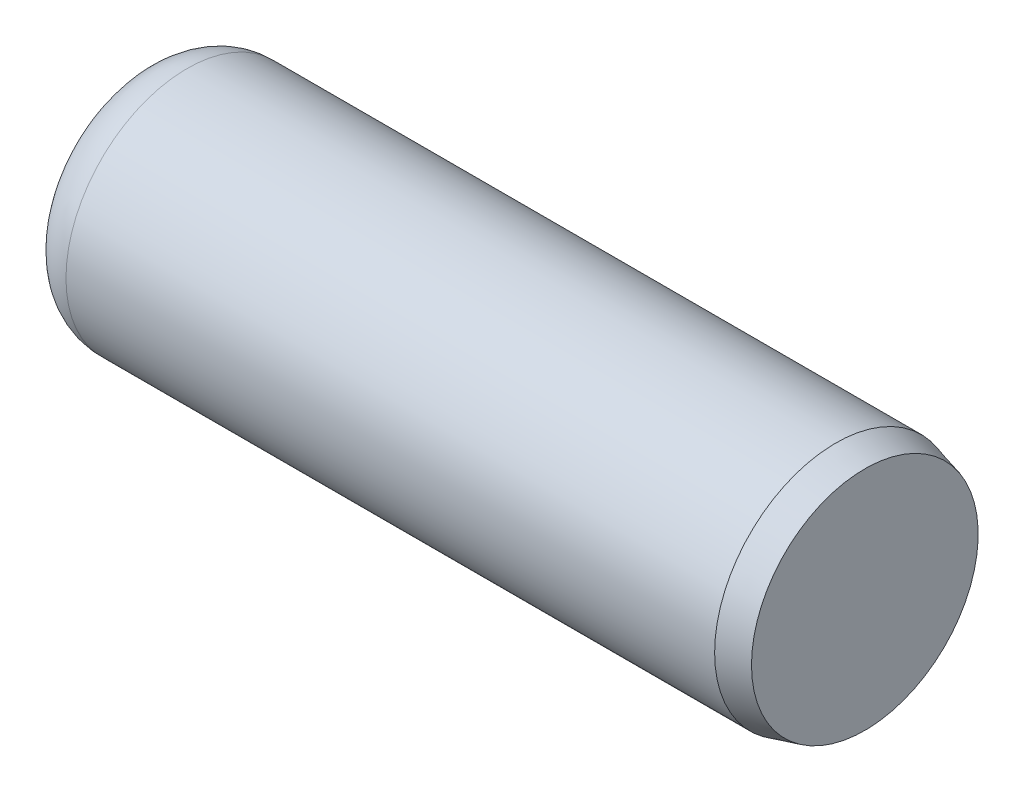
from build123d import *


with BuildPart() as part:
    # Sketch1 → Base-Revolve (revolve)
    with BuildSketch(Plane.XY, mode=Mode.PRIVATE) as base_revolve_sk:
        with BuildLine():
            Line((0, 0), (19.05, 0))
            Line((19.05, 0), (19.05, 2.973199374))
            Line((19.05, 2.973199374), (18.2873904, 3.17754))
            Line((18.2873904, 3.17754), (1.271016, 3.17754))
            ThreePointArc((1.271016, 3.17754), (0.372271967, 2.805268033), (0, 1.906524))
            Line((0, 1.906524), (0, 0))
        make_face()
    revolve(base_revolve_sk.sketch.rotate(Axis((-6.35, 0, 0), (1, 0, 0)), 90), axis=Axis((-6.35, 0, 0), (1, 0, 0)))


solid = part.part
